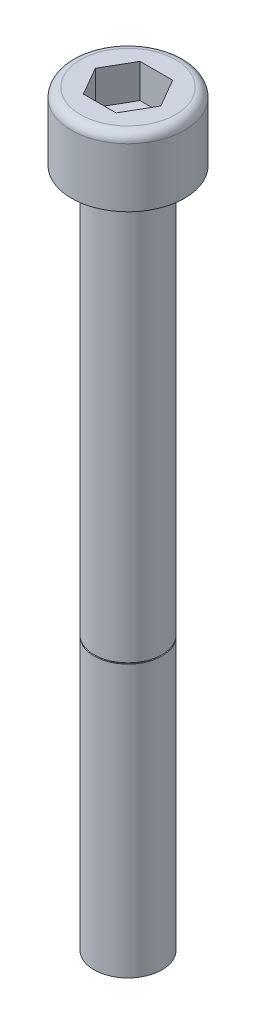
ISO-10303-21;
HEADER;
FILE_DESCRIPTION(('STEP AP214'),'2;1');
FILE_NAME('part.step','',(''),(''),'','','');
FILE_SCHEMA(('AUTOMOTIVE_DESIGN { 1 0 10303 214 1 1 1 1 }'));
ENDSEC;
DATA;
#1=APPLICATION_CONTEXT('core data for automotive mechanical design processes');
#2=APPLICATION_PROTOCOL_DEFINITION('international standard','automotive_design',2000,#1);
#3=PRODUCT_CONTEXT('',#1,'mechanical');
#4=PRODUCT('Part','Part','',(#3));
#5=PRODUCT_RELATED_PRODUCT_CATEGORY('part','',(#4));
#6=PRODUCT_DEFINITION_FORMATION('','',#4);
#7=PRODUCT_DEFINITION_CONTEXT('part definition',#1,'design');
#8=PRODUCT_DEFINITION('design','',#6,#7);
#9=PRODUCT_DEFINITION_SHAPE('','',#8);
#10=(LENGTH_UNIT() NAMED_UNIT(*) SI_UNIT(.MILLI.,.METRE.));
#11=(NAMED_UNIT(*) PLANE_ANGLE_UNIT() SI_UNIT($,.RADIAN.));
#12=(NAMED_UNIT(*) SI_UNIT($,.STERADIAN.) SOLID_ANGLE_UNIT());
#13=UNCERTAINTY_MEASURE_WITH_UNIT(LENGTH_MEASURE(1.E-05),#10,'distance_accuracy_value','');
#14=(GEOMETRIC_REPRESENTATION_CONTEXT(3) GLOBAL_UNCERTAINTY_ASSIGNED_CONTEXT((#13)) GLOBAL_UNIT_ASSIGNED_CONTEXT((#10,
#11,#12)) REPRESENTATION_CONTEXT('',''));
#15=CARTESIAN_POINT('',(0.,0.,0.));
#16=DIRECTION('',(0.,0.,1.));
#17=DIRECTION('',(1.,0.,0.));
#18=AXIS2_PLACEMENT_3D('',#15,#16,#17);
#19=CARTESIAN_POINT('',(0.,0.,0.));
#20=DIRECTION('',(0.,1.,0.));
#21=DIRECTION('',(0.,0.,1.));
#22=AXIS2_PLACEMENT_3D('',#19,#20,#21);
#23=PLANE('',#22);
#24=CARTESIAN_POINT('',(0.,0.,0.));
#25=DIRECTION('',(0.,-1.,0.));
#26=DIRECTION('',(0.,0.,-1.));
#27=AXIS2_PLACEMENT_3D('',#24,#25,#26);
#28=CIRCLE('',#27,3.);
#29=CARTESIAN_POINT('',(0.,0.,-3.));
#30=VERTEX_POINT('',#29);
#31=EDGE_CURVE('E11',#30,#30,#28,.T.);
#32=ORIENTED_EDGE('',*,*,#31,.T.);
#33=EDGE_LOOP('',(#32));
#34=FACE_BOUND('',#33,.T.);
#35=ADVANCED_FACE('F36',(#34),#23,.F.);
#36=CARTESIAN_POINT('',(0.,0.,0.));
#37=DIRECTION('',(0.,-1.,0.));
#38=DIRECTION('',(0.,0.,-1.));
#39=AXIS2_PLACEMENT_3D('',#36,#37,#38);
#40=CYLINDRICAL_SURFACE('',#39,3.);
#41=ORIENTED_EDGE('',*,*,#31,.F.);
#42=EDGE_LOOP('',(#41));
#43=FACE_BOUND('',#42,.T.);
#44=CARTESIAN_POINT('',(0.,24.,0.));
#45=DIRECTION('',(0.,-1.,0.));
#46=DIRECTION('',(0.,0.,-1.));
#47=AXIS2_PLACEMENT_3D('',#44,#45,#46);
#48=CIRCLE('',#47,3.);
#49=CARTESIAN_POINT('',(0.,24.,-3.));
#50=VERTEX_POINT('',#49);
#51=EDGE_CURVE('E43',#50,#50,#48,.T.);
#52=ORIENTED_EDGE('',*,*,#51,.T.);
#53=EDGE_LOOP('',(#52));
#54=FACE_BOUND('',#53,.T.);
#55=ADVANCED_FACE('F165',(#43,#54),#40,.T.);
#56=CARTESIAN_POINT('',(-3.,24.,0.));
#57=DIRECTION('',(0.,-1.,0.));
#58=DIRECTION('',(0.,0.,-1.));
#59=AXIS2_PLACEMENT_3D('',#56,#57,#58);
#60=PLANE('',#59);
#61=ORIENTED_EDGE('',*,*,#51,.F.);
#62=EDGE_LOOP('',(#61));
#63=FACE_BOUND('',#62,.T.);
#64=CARTESIAN_POINT('',(0.,24.,0.));
#65=DIRECTION('',(0.,-1.,0.));
#66=DIRECTION('',(0.,0.,-1.));
#67=AXIS2_PLACEMENT_3D('',#64,#65,#66);
#68=CIRCLE('',#67,2.9);
#69=CARTESIAN_POINT('',(0.,24.,-2.9));
#70=VERTEX_POINT('',#69);
#71=EDGE_CURVE('E160',#70,#70,#68,.T.);
#72=ORIENTED_EDGE('',*,*,#71,.T.);
#73=EDGE_LOOP('',(#72));
#74=FACE_BOUND('',#73,.T.);
#75=ADVANCED_FACE('F167',(#63,#74),#60,.F.);
#76=CARTESIAN_POINT('',(0.,0.,0.));
#77=DIRECTION('',(0.,-1.,0.));
#78=DIRECTION('',(0.,0.,-1.));
#79=AXIS2_PLACEMENT_3D('',#76,#77,#78);
#80=CYLINDRICAL_SURFACE('',#79,2.9);
#81=ORIENTED_EDGE('',*,*,#71,.F.);
#82=EDGE_LOOP('',(#81));
#83=FACE_BOUND('',#82,.T.);
#84=CARTESIAN_POINT('',(0.,24.1,0.));
#85=DIRECTION('',(0.,-1.,0.));
#86=DIRECTION('',(0.,0.,-1.));
#87=AXIS2_PLACEMENT_3D('',#84,#85,#86);
#88=CIRCLE('',#87,2.9);
#89=CARTESIAN_POINT('',(0.,24.1,-2.9));
#90=VERTEX_POINT('',#89);
#91=EDGE_CURVE('E157',#90,#90,#88,.T.);
#92=ORIENTED_EDGE('',*,*,#91,.T.);
#93=EDGE_LOOP('',(#92));
#94=FACE_BOUND('',#93,.T.);
#95=ADVANCED_FACE('F170',(#83,#94),#80,.T.);
#96=CARTESIAN_POINT('',(-3.,24.1,0.));
#97=DIRECTION('',(0.,1.,0.));
#98=DIRECTION('',(0.,0.,1.));
#99=AXIS2_PLACEMENT_3D('',#96,#97,#98);
#100=PLANE('',#99);
#101=ORIENTED_EDGE('',*,*,#91,.F.);
#102=EDGE_LOOP('',(#101));
#103=FACE_BOUND('',#102,.T.);
#104=CARTESIAN_POINT('',(0.,24.1,0.));
#105=DIRECTION('',(0.,-1.,0.));
#106=DIRECTION('',(0.,0.,-1.));
#107=AXIS2_PLACEMENT_3D('',#104,#105,#106);
#108=CIRCLE('',#107,3.);
#109=CARTESIAN_POINT('',(0.,24.1,-3.));
#110=VERTEX_POINT('',#109);
#111=EDGE_CURVE('E154',#110,#110,#108,.T.);
#112=ORIENTED_EDGE('',*,*,#111,.T.);
#113=EDGE_LOOP('',(#112));
#114=FACE_BOUND('',#113,.T.);
#115=ADVANCED_FACE('F176',(#103,#114),#100,.F.);
#116=CARTESIAN_POINT('',(0.,0.,0.));
#117=DIRECTION('',(0.,-1.,0.));
#118=DIRECTION('',(0.,0.,-1.));
#119=AXIS2_PLACEMENT_3D('',#116,#117,#118);
#120=CYLINDRICAL_SURFACE('',#119,3.);
#121=ORIENTED_EDGE('',*,*,#111,.F.);
#122=EDGE_LOOP('',(#121));
#123=FACE_BOUND('',#122,.T.);
#124=CARTESIAN_POINT('',(0.,60.,0.));
#125=DIRECTION('',(0.,-1.,0.));
#126=DIRECTION('',(0.,0.,-1.));
#127=AXIS2_PLACEMENT_3D('',#124,#125,#126);
#128=CIRCLE('',#127,3.);
#129=CARTESIAN_POINT('',(0.,60.,-3.));
#130=VERTEX_POINT('',#129);
#131=EDGE_CURVE('E151',#130,#130,#128,.T.);
#132=ORIENTED_EDGE('',*,*,#131,.T.);
#133=EDGE_LOOP('',(#132));
#134=FACE_BOUND('',#133,.T.);
#135=ADVANCED_FACE('F182',(#123,#134),#120,.T.);
#136=CARTESIAN_POINT('',(-3.,60.,0.));
#137=DIRECTION('',(0.,1.,0.));
#138=DIRECTION('',(0.,0.,1.));
#139=AXIS2_PLACEMENT_3D('',#136,#137,#138);
#140=PLANE('',#139);
#141=ORIENTED_EDGE('',*,*,#131,.F.);
#142=EDGE_LOOP('',(#141));
#143=FACE_BOUND('',#142,.T.);
#144=CARTESIAN_POINT('',(0.,60.,0.));
#145=DIRECTION('',(0.,-1.,0.));
#146=DIRECTION('',(0.,0.,-1.));
#147=AXIS2_PLACEMENT_3D('',#144,#145,#146);
#148=CIRCLE('',#147,5.);
#149=CARTESIAN_POINT('',(0.,60.,-5.));
#150=VERTEX_POINT('',#149);
#151=EDGE_CURVE('E148',#150,#150,#148,.T.);
#152=ORIENTED_EDGE('',*,*,#151,.T.);
#153=EDGE_LOOP('',(#152));
#154=FACE_BOUND('',#153,.T.);
#155=ADVANCED_FACE('F188',(#143,#154),#140,.F.);
#156=CARTESIAN_POINT('',(0.,0.,0.));
#157=DIRECTION('',(0.,-1.,0.));
#158=DIRECTION('',(0.,0.,-1.));
#159=AXIS2_PLACEMENT_3D('',#156,#157,#158);
#160=CYLINDRICAL_SURFACE('',#159,5.);
#161=ORIENTED_EDGE('',*,*,#151,.F.);
#162=EDGE_LOOP('',(#161));
#163=FACE_BOUND('',#162,.T.);
#164=CARTESIAN_POINT('',(0.,65.2,0.));
#165=DIRECTION('',(0.,-1.,0.));
#166=DIRECTION('',(0.,0.,-1.));
#167=AXIS2_PLACEMENT_3D('',#164,#165,#166);
#168=CIRCLE('',#167,5.);
#169=CARTESIAN_POINT('',(0.,65.2,-5.));
#170=VERTEX_POINT('',#169);
#171=EDGE_CURVE('E145',#170,#170,#168,.T.);
#172=ORIENTED_EDGE('',*,*,#171,.T.);
#173=EDGE_LOOP('',(#172));
#174=FACE_BOUND('',#173,.T.);
#175=ADVANCED_FACE('F194',(#163,#174),#160,.T.);
#176=CARTESIAN_POINT('',(0.,65.2,0.));
#177=DIRECTION('',(0.,-1.,0.));
#178=DIRECTION('',(0.,0.,-1.));
#179=AXIS2_PLACEMENT_3D('',#176,#177,#178);
#180=TOROIDAL_SURFACE('',#179,4.2,0.799999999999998);
#181=ORIENTED_EDGE('',*,*,#171,.F.);
#182=EDGE_LOOP('',(#181));
#183=FACE_BOUND('',#182,.T.);
#184=CARTESIAN_POINT('',(0.,66.,0.));
#185=DIRECTION('',(0.,-1.,0.));
#186=DIRECTION('',(0.,0.,-1.));
#187=AXIS2_PLACEMENT_3D('',#184,#185,#186);
#188=CIRCLE('',#187,4.2);
#189=CARTESIAN_POINT('',(0.,66.,-4.2));
#190=VERTEX_POINT('',#189);
#191=EDGE_CURVE('E137',#190,#190,#188,.T.);
#192=ORIENTED_EDGE('',*,*,#191,.T.);
#193=EDGE_LOOP('',(#192));
#194=FACE_BOUND('',#193,.T.);
#195=ADVANCED_FACE('F200',(#183,#194),#180,.T.);
#196=CARTESIAN_POINT('',(-4.2,66.,0.));
#197=DIRECTION('',(0.,-1.,0.));
#198=DIRECTION('',(0.,0.,-1.));
#199=AXIS2_PLACEMENT_3D('',#196,#197,#198);
#200=PLANE('',#199);
#201=DIRECTION('',(-1.,0.,0.));
#202=VECTOR('',#201,1.);
#203=CARTESIAN_POINT('',(1.44337567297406,66.,-2.5));
#204=LINE('',#203,#202);
#205=CARTESIAN_POINT('',(1.44337567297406,66.,-2.5));
#206=VERTEX_POINT('',#205);
#207=CARTESIAN_POINT('',(-1.44337567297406,66.,-2.5));
#208=VERTEX_POINT('',#207);
#209=EDGE_CURVE('E124',#206,#208,#204,.T.);
#210=ORIENTED_EDGE('',*,*,#209,.F.);
#211=DIRECTION('',(-0.5,0.,-0.866025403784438));
#212=VECTOR('',#211,1.);
#213=CARTESIAN_POINT('',(2.88675134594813,66.,0.));
#214=LINE('',#213,#212);
#215=CARTESIAN_POINT('',(2.88675134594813,66.,0.));
#216=VERTEX_POINT('',#215);
#217=EDGE_CURVE('E50',#216,#206,#214,.T.);
#218=ORIENTED_EDGE('',*,*,#217,.F.);
#219=DIRECTION('',(0.5,0.,-0.866025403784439));
#220=VECTOR('',#219,1.);
#221=CARTESIAN_POINT('',(1.44337567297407,66.,2.5));
#222=LINE('',#221,#220);
#223=CARTESIAN_POINT('',(1.44337567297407,66.,2.5));
#224=VERTEX_POINT('',#223);
#225=EDGE_CURVE('E133',#224,#216,#222,.T.);
#226=ORIENTED_EDGE('',*,*,#225,.F.);
#227=DIRECTION('',(1.,0.,0.));
#228=VECTOR('',#227,1.);
#229=CARTESIAN_POINT('',(-1.44337567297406,66.,2.5));
#230=LINE('',#229,#228);
#231=CARTESIAN_POINT('',(-1.44337567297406,66.,2.5));
#232=VERTEX_POINT('',#231);
#233=EDGE_CURVE('E131',#232,#224,#230,.T.);
#234=ORIENTED_EDGE('',*,*,#233,.F.);
#235=DIRECTION('',(0.5,0.,0.866025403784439));
#236=VECTOR('',#235,1.);
#237=CARTESIAN_POINT('',(-2.88675134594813,66.,0.));
#238=LINE('',#237,#236);
#239=CARTESIAN_POINT('',(-2.88675134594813,66.,0.));
#240=VERTEX_POINT('',#239);
#241=EDGE_CURVE('E98',#240,#232,#238,.T.);
#242=ORIENTED_EDGE('',*,*,#241,.F.);
#243=DIRECTION('',(-0.5,0.,0.866025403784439));
#244=VECTOR('',#243,1.);
#245=CARTESIAN_POINT('',(-1.44337567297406,66.,-2.5));
#246=LINE('',#245,#244);
#247=EDGE_CURVE('E127',#208,#240,#246,.T.);
#248=ORIENTED_EDGE('',*,*,#247,.F.);
#249=EDGE_LOOP('',(#210,#218,#226,#234,#242,#248));
#250=FACE_BOUND('',#249,.T.);
#251=ORIENTED_EDGE('',*,*,#191,.F.);
#252=EDGE_LOOP('',(#251));
#253=FACE_BOUND('',#252,.T.);
#254=ADVANCED_FACE('F206',(#250,#253),#200,.F.);
#255=CARTESIAN_POINT('',(2.88675134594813,63.,0.));
#256=DIRECTION('',(0.866025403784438,0.,-0.5));
#257=DIRECTION('',(-0.5,0.,-0.866025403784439));
#258=AXIS2_PLACEMENT_3D('',#255,#256,#257);
#259=PLANE('',#258);
#260=ORIENTED_EDGE('',*,*,#217,.T.);
#261=DIRECTION('',(0.,1.,0.));
#262=VECTOR('',#261,1.);
#263=CARTESIAN_POINT('',(1.44337567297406,63.,-2.5));
#264=LINE('',#263,#262);
#265=CARTESIAN_POINT('',(1.44337567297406,63.,-2.5));
#266=VERTEX_POINT('',#265);
#267=EDGE_CURVE('E80',#266,#206,#264,.T.);
#268=ORIENTED_EDGE('',*,*,#267,.F.);
#269=DIRECTION('',(-0.5,0.,-0.866025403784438));
#270=VECTOR('',#269,1.);
#271=CARTESIAN_POINT('',(2.88675134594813,63.,0.));
#272=LINE('',#271,#270);
#273=CARTESIAN_POINT('',(2.88675134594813,63.,0.));
#274=VERTEX_POINT('',#273);
#275=EDGE_CURVE('E135',#274,#266,#272,.T.);
#276=ORIENTED_EDGE('',*,*,#275,.F.);
#277=DIRECTION('',(0.,1.,0.));
#278=VECTOR('',#277,1.);
#279=CARTESIAN_POINT('',(2.88675134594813,63.,0.));
#280=LINE('',#279,#278);
#281=EDGE_CURVE('E58',#274,#216,#280,.T.);
#282=ORIENTED_EDGE('',*,*,#281,.T.);
#283=EDGE_LOOP('',(#260,#268,#276,#282));
#284=FACE_BOUND('',#283,.T.);
#285=ADVANCED_FACE('F211',(#284),#259,.F.);
#286=CARTESIAN_POINT('',(1.44337567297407,63.,2.5));
#287=DIRECTION('',(0.866025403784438,0.,0.5));
#288=DIRECTION('',(0.5,0.,-0.866025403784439));
#289=AXIS2_PLACEMENT_3D('',#286,#287,#288);
#290=PLANE('',#289);
#291=ORIENTED_EDGE('',*,*,#225,.T.);
#292=ORIENTED_EDGE('',*,*,#281,.F.);
#293=DIRECTION('',(0.5,0.,-0.866025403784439));
#294=VECTOR('',#293,1.);
#295=CARTESIAN_POINT('',(1.44337567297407,63.,2.5));
#296=LINE('',#295,#294);
#297=CARTESIAN_POINT('',(1.44337567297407,63.,2.5));
#298=VERTEX_POINT('',#297);
#299=EDGE_CURVE('E110',#298,#274,#296,.T.);
#300=ORIENTED_EDGE('',*,*,#299,.F.);
#301=DIRECTION('',(0.,1.,0.));
#302=VECTOR('',#301,1.);
#303=CARTESIAN_POINT('',(1.44337567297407,63.,2.5));
#304=LINE('',#303,#302);
#305=EDGE_CURVE('E102',#298,#224,#304,.T.);
#306=ORIENTED_EDGE('',*,*,#305,.T.);
#307=EDGE_LOOP('',(#291,#292,#300,#306));
#308=FACE_BOUND('',#307,.T.);
#309=ADVANCED_FACE('F217',(#308),#290,.F.);
#310=CARTESIAN_POINT('',(-1.44337567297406,63.,2.5));
#311=DIRECTION('',(0.,0.,1.));
#312=DIRECTION('',(1.,0.,0.));
#313=AXIS2_PLACEMENT_3D('',#310,#311,#312);
#314=PLANE('',#313);
#315=ORIENTED_EDGE('',*,*,#233,.T.);
#316=ORIENTED_EDGE('',*,*,#305,.F.);
#317=DIRECTION('',(1.,0.,0.));
#318=VECTOR('',#317,1.);
#319=CARTESIAN_POINT('',(-1.44337567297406,63.,2.5));
#320=LINE('',#319,#318);
#321=CARTESIAN_POINT('',(-1.44337567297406,63.,2.5));
#322=VERTEX_POINT('',#321);
#323=EDGE_CURVE('E106',#322,#298,#320,.T.);
#324=ORIENTED_EDGE('',*,*,#323,.F.);
#325=DIRECTION('',(0.,1.,0.));
#326=VECTOR('',#325,1.);
#327=CARTESIAN_POINT('',(-1.44337567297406,63.,2.5));
#328=LINE('',#327,#326);
#329=EDGE_CURVE('E91',#322,#232,#328,.T.);
#330=ORIENTED_EDGE('',*,*,#329,.T.);
#331=EDGE_LOOP('',(#315,#316,#324,#330));
#332=FACE_BOUND('',#331,.T.);
#333=ADVANCED_FACE('F107',(#332),#314,.F.);
#334=CARTESIAN_POINT('',(-2.88675134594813,63.,0.));
#335=DIRECTION('',(-0.866025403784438,0.,0.5));
#336=DIRECTION('',(0.5,0.,0.866025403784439));
#337=AXIS2_PLACEMENT_3D('',#334,#335,#336);
#338=PLANE('',#337);
#339=ORIENTED_EDGE('',*,*,#241,.T.);
#340=ORIENTED_EDGE('',*,*,#329,.F.);
#341=DIRECTION('',(0.5,0.,0.866025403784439));
#342=VECTOR('',#341,1.);
#343=CARTESIAN_POINT('',(-2.88675134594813,63.,0.));
#344=LINE('',#343,#342);
#345=CARTESIAN_POINT('',(-2.88675134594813,63.,0.));
#346=VERTEX_POINT('',#345);
#347=EDGE_CURVE('E95',#346,#322,#344,.T.);
#348=ORIENTED_EDGE('',*,*,#347,.F.);
#349=DIRECTION('',(0.,1.,0.));
#350=VECTOR('',#349,1.);
#351=CARTESIAN_POINT('',(-2.88675134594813,63.,0.));
#352=LINE('',#351,#350);
#353=EDGE_CURVE('E103',#346,#240,#352,.T.);
#354=ORIENTED_EDGE('',*,*,#353,.T.);
#355=EDGE_LOOP('',(#339,#340,#348,#354));
#356=FACE_BOUND('',#355,.T.);
#357=ADVANCED_FACE('F93',(#356),#338,.F.);
#358=CARTESIAN_POINT('',(-1.44337567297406,63.,-2.5));
#359=DIRECTION('',(-0.866025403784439,0.,-0.5));
#360=DIRECTION('',(-0.5,0.,0.866025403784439));
#361=AXIS2_PLACEMENT_3D('',#358,#359,#360);
#362=PLANE('',#361);
#363=ORIENTED_EDGE('',*,*,#247,.T.);
#364=ORIENTED_EDGE('',*,*,#353,.F.);
#365=DIRECTION('',(-0.5,0.,0.866025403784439));
#366=VECTOR('',#365,1.);
#367=CARTESIAN_POINT('',(-1.44337567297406,63.,-2.5));
#368=LINE('',#367,#366);
#369=CARTESIAN_POINT('',(-1.44337567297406,63.,-2.5));
#370=VERTEX_POINT('',#369);
#371=EDGE_CURVE('E116',#370,#346,#368,.T.);
#372=ORIENTED_EDGE('',*,*,#371,.F.);
#373=DIRECTION('',(0.,1.,0.));
#374=VECTOR('',#373,1.);
#375=CARTESIAN_POINT('',(-1.44337567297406,63.,-2.5));
#376=LINE('',#375,#374);
#377=EDGE_CURVE('E140',#370,#208,#376,.T.);
#378=ORIENTED_EDGE('',*,*,#377,.T.);
#379=EDGE_LOOP('',(#363,#364,#372,#378));
#380=FACE_BOUND('',#379,.T.);
#381=ADVANCED_FACE('F292',(#380),#362,.F.);
#382=CARTESIAN_POINT('',(1.44337567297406,63.,-2.5));
#383=DIRECTION('',(0.,0.,-1.));
#384=DIRECTION('',(-1.,0.,0.));
#385=AXIS2_PLACEMENT_3D('',#382,#383,#384);
#386=PLANE('',#385);
#387=ORIENTED_EDGE('',*,*,#209,.T.);
#388=ORIENTED_EDGE('',*,*,#377,.F.);
#389=DIRECTION('',(-1.,0.,0.));
#390=VECTOR('',#389,1.);
#391=CARTESIAN_POINT('',(1.44337567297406,63.,-2.5));
#392=LINE('',#391,#390);
#393=EDGE_CURVE('E118',#266,#370,#392,.T.);
#394=ORIENTED_EDGE('',*,*,#393,.F.);
#395=ORIENTED_EDGE('',*,*,#267,.T.);
#396=EDGE_LOOP('',(#387,#388,#394,#395));
#397=FACE_BOUND('',#396,.T.);
#398=ADVANCED_FACE('F301',(#397),#386,.F.);
#399=CARTESIAN_POINT('',(0.,63.,0.));
#400=DIRECTION('',(0.,1.,0.));
#401=DIRECTION('',(0.,0.,1.));
#402=AXIS2_PLACEMENT_3D('',#399,#400,#401);
#403=PLANE('',#402);
#404=ORIENTED_EDGE('',*,*,#275,.T.);
#405=ORIENTED_EDGE('',*,*,#393,.T.);
#406=ORIENTED_EDGE('',*,*,#371,.T.);
#407=ORIENTED_EDGE('',*,*,#347,.T.);
#408=ORIENTED_EDGE('',*,*,#323,.T.);
#409=ORIENTED_EDGE('',*,*,#299,.T.);
#410=EDGE_LOOP('',(#404,#405,#406,#407,#408,#409));
#411=FACE_BOUND('',#410,.T.);
#412=ADVANCED_FACE('F113',(#411),#403,.T.);
#413=CLOSED_SHELL('',(#35,#55,#75,#95,#115,#135,#155,#175,#195,#254,#285,#309,#333,#357,#381,
#398,#412));
#414=MANIFOLD_SOLID_BREP('B2',#413);
#415=ADVANCED_BREP_SHAPE_REPRESENTATION('',(#18,#414),#14);
#416=SHAPE_DEFINITION_REPRESENTATION(#9,#415);
ENDSEC;
END-ISO-10303-21;
